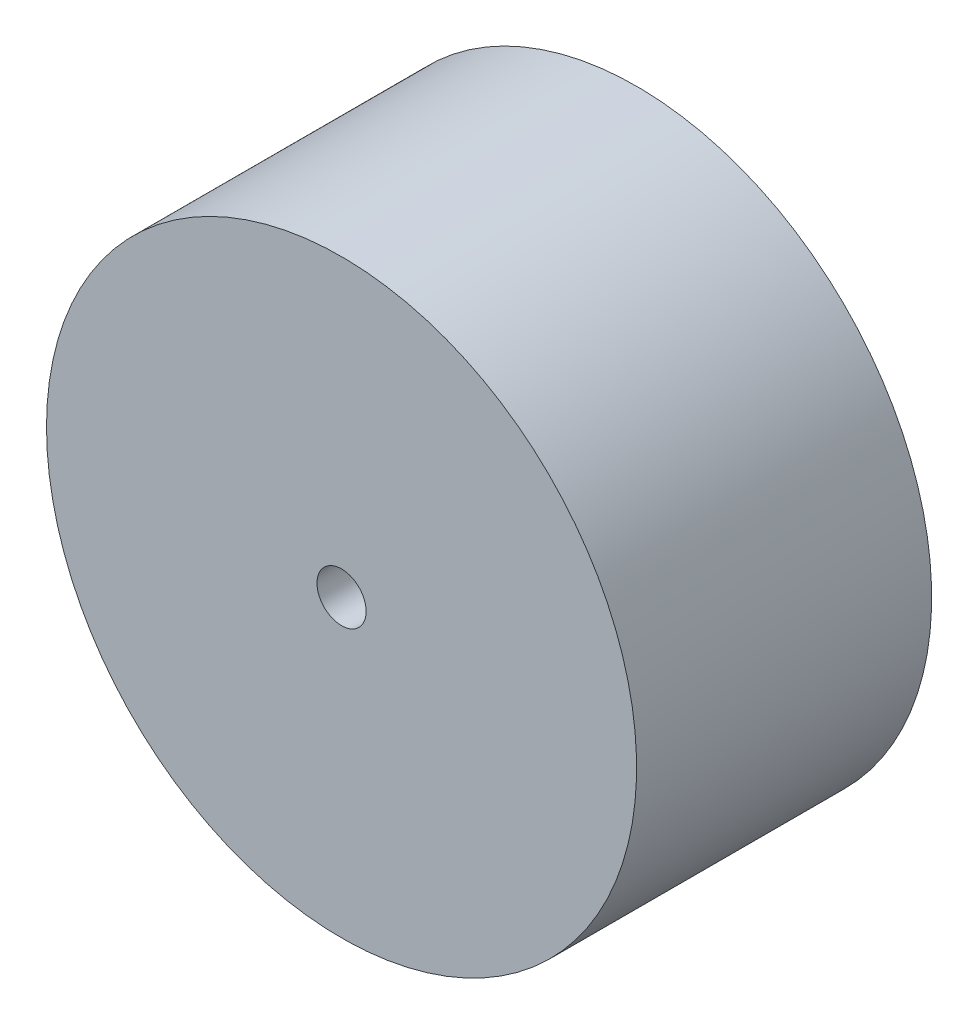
ISO-10303-21;
HEADER;
FILE_DESCRIPTION(('STEP AP214'),'2;1');
FILE_NAME('part.step','',(''),(''),'','','');
FILE_SCHEMA(('AUTOMOTIVE_DESIGN { 1 0 10303 214 1 1 1 1 }'));
ENDSEC;
DATA;
#1=APPLICATION_CONTEXT('core data for automotive mechanical design processes');
#2=APPLICATION_PROTOCOL_DEFINITION('international standard','automotive_design',2000,#1);
#3=PRODUCT_CONTEXT('',#1,'mechanical');
#4=PRODUCT('Part','Part','',(#3));
#5=PRODUCT_RELATED_PRODUCT_CATEGORY('part','',(#4));
#6=PRODUCT_DEFINITION_FORMATION('','',#4);
#7=PRODUCT_DEFINITION_CONTEXT('part definition',#1,'design');
#8=PRODUCT_DEFINITION('design','',#6,#7);
#9=PRODUCT_DEFINITION_SHAPE('','',#8);
#10=(LENGTH_UNIT() NAMED_UNIT(*) SI_UNIT(.MILLI.,.METRE.));
#11=(NAMED_UNIT(*) PLANE_ANGLE_UNIT() SI_UNIT($,.RADIAN.));
#12=(NAMED_UNIT(*) SI_UNIT($,.STERADIAN.) SOLID_ANGLE_UNIT());
#13=UNCERTAINTY_MEASURE_WITH_UNIT(LENGTH_MEASURE(1.E-05),#10,'distance_accuracy_value','');
#14=(GEOMETRIC_REPRESENTATION_CONTEXT(3) GLOBAL_UNCERTAINTY_ASSIGNED_CONTEXT((#13)) GLOBAL_UNIT_ASSIGNED_CONTEXT((#10,
#11,#12)) REPRESENTATION_CONTEXT('',''));
#15=CARTESIAN_POINT('',(0.,0.,0.));
#16=DIRECTION('',(0.,0.,1.));
#17=DIRECTION('',(1.,0.,0.));
#18=AXIS2_PLACEMENT_3D('',#15,#16,#17);
#19=CARTESIAN_POINT('',(0.,0.,38.1));
#20=DIRECTION('',(0.,0.,-1.));
#21=DIRECTION('',(-1.,0.,0.));
#22=AXIS2_PLACEMENT_3D('',#19,#20,#21);
#23=CYLINDRICAL_SURFACE('',#22,38.1);
#24=CARTESIAN_POINT('',(0.,0.,38.1));
#25=DIRECTION('',(0.,0.,1.));
#26=DIRECTION('',(1.,0.,0.));
#27=AXIS2_PLACEMENT_3D('',#24,#25,#26);
#28=CIRCLE('',#27,38.1);
#29=CARTESIAN_POINT('',(-38.1,0.,38.1));
#30=VERTEX_POINT('',#29);
#31=EDGE_CURVE('E10',#30,#30,#28,.T.);
#32=CARTESIAN_POINT('',(0.,0.,0.));
#33=DIRECTION('',(0.,0.,1.));
#34=DIRECTION('',(1.,0.,0.));
#35=AXIS2_PLACEMENT_3D('',#32,#33,#34);
#36=CIRCLE('',#35,38.1);
#37=CARTESIAN_POINT('',(-38.1,0.,0.));
#38=VERTEX_POINT('',#37);
#39=EDGE_CURVE('E44',#38,#38,#36,.T.);
#40=CARTESIAN_POINT('',(-38.1,0.,38.1));
#41=CARTESIAN_POINT('',(-38.1,0.,37.703125));
#42=CARTESIAN_POINT('',(-38.1,0.,37.30625));
#43=CARTESIAN_POINT('',(-38.1,0.,36.5125));
#44=CARTESIAN_POINT('',(-38.1,0.,36.115625));
#45=CARTESIAN_POINT('',(-38.1,0.,35.321875));
#46=CARTESIAN_POINT('',(-38.1,0.,34.925));
#47=CARTESIAN_POINT('',(-38.1,0.,34.13125));
#48=CARTESIAN_POINT('',(-38.1,0.,33.734375));
#49=CARTESIAN_POINT('',(-38.1,0.,32.940625));
#50=CARTESIAN_POINT('',(-38.1,0.,32.54375));
#51=CARTESIAN_POINT('',(-38.1,0.,31.75));
#52=CARTESIAN_POINT('',(-38.1,0.,31.353125));
#53=CARTESIAN_POINT('',(-38.1,0.,30.559375));
#54=CARTESIAN_POINT('',(-38.1,0.,30.1625));
#55=CARTESIAN_POINT('',(-38.1,0.,29.36875));
#56=CARTESIAN_POINT('',(-38.1,0.,28.971875));
#57=CARTESIAN_POINT('',(-38.1,0.,28.178125));
#58=CARTESIAN_POINT('',(-38.1,0.,27.78125));
#59=CARTESIAN_POINT('',(-38.1,0.,26.9875));
#60=CARTESIAN_POINT('',(-38.1,0.,26.590625));
#61=CARTESIAN_POINT('',(-38.1,0.,25.796875));
#62=CARTESIAN_POINT('',(-38.1,0.,25.4));
#63=CARTESIAN_POINT('',(-38.1,0.,24.60625));
#64=CARTESIAN_POINT('',(-38.1,0.,24.209375));
#65=CARTESIAN_POINT('',(-38.1,0.,23.415625));
#66=CARTESIAN_POINT('',(-38.1,0.,23.01875));
#67=CARTESIAN_POINT('',(-38.1,0.,22.225));
#68=CARTESIAN_POINT('',(-38.1,0.,21.828125));
#69=CARTESIAN_POINT('',(-38.1,0.,21.034375));
#70=CARTESIAN_POINT('',(-38.1,0.,20.6375));
#71=CARTESIAN_POINT('',(-38.1,0.,19.84375));
#72=CARTESIAN_POINT('',(-38.1,0.,19.446875));
#73=CARTESIAN_POINT('',(-38.1,0.,18.653125));
#74=CARTESIAN_POINT('',(-38.1,0.,18.25625));
#75=CARTESIAN_POINT('',(-38.1,0.,17.4625));
#76=CARTESIAN_POINT('',(-38.1,0.,17.065625));
#77=CARTESIAN_POINT('',(-38.1,0.,16.271875));
#78=CARTESIAN_POINT('',(-38.1,0.,15.875));
#79=CARTESIAN_POINT('',(-38.1,0.,15.08125));
#80=CARTESIAN_POINT('',(-38.1,0.,14.684375));
#81=CARTESIAN_POINT('',(-38.1,0.,13.890625));
#82=CARTESIAN_POINT('',(-38.1,0.,13.49375));
#83=CARTESIAN_POINT('',(-38.1,0.,12.7));
#84=CARTESIAN_POINT('',(-38.1,0.,12.303125));
#85=CARTESIAN_POINT('',(-38.1,0.,11.509375));
#86=CARTESIAN_POINT('',(-38.1,0.,11.1125));
#87=CARTESIAN_POINT('',(-38.1,0.,10.31875));
#88=CARTESIAN_POINT('',(-38.1,0.,9.92187499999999));
#89=CARTESIAN_POINT('',(-38.1,0.,9.128125));
#90=CARTESIAN_POINT('',(-38.1,0.,8.73124999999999));
#91=CARTESIAN_POINT('',(-38.1,0.,7.93749999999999));
#92=CARTESIAN_POINT('',(-38.1,0.,7.54062499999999));
#93=CARTESIAN_POINT('',(-38.1,0.,6.746875));
#94=CARTESIAN_POINT('',(-38.1,0.,6.35));
#95=CARTESIAN_POINT('',(-38.1,0.,5.55625));
#96=CARTESIAN_POINT('',(-38.1,0.,5.159375));
#97=CARTESIAN_POINT('',(-38.1,0.,4.365625));
#98=CARTESIAN_POINT('',(-38.1,0.,3.96875));
#99=CARTESIAN_POINT('',(-38.1,0.,3.175));
#100=CARTESIAN_POINT('',(-38.1,0.,2.778125));
#101=CARTESIAN_POINT('',(-38.1,0.,1.984375));
#102=CARTESIAN_POINT('',(-38.1,0.,1.5875));
#103=CARTESIAN_POINT('',(-38.1,0.,0.79375));
#104=CARTESIAN_POINT('',(-38.1,0.,0.396875));
#105=CARTESIAN_POINT('',(-38.1,0.,0.));
#106=B_SPLINE_CURVE_WITH_KNOTS('',3,(#40,#41,#42,#43,#44,#45,#46,#47,#48,#49,#50,#51,#52,#53,
#54,#55,#56,#57,#58,#59,#60,#61,#62,#63,#64,#65,#66,#67,#68,#69,#70,#71,#72,#73,#74,#75,#76,#77,
#78,#79,#80,#81,#82,#83,#84,#85,#86,#87,#88,#89,#90,#91,#92,#93,#94,#95,#96,#97,#98,#99,#100,
#101,#102,#103,#104,#105),.UNSPECIFIED.,.F.,.F.,(4,2,2,2,2,2,2,2,2,2,2,2,2,2,2,2,2,2,2,2,2,2,2,
2,2,2,2,2,2,2,2,2,4),(0.,1.190625,2.38125,3.571875,4.7625,5.953125,7.14375,8.334375,
9.52500000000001,10.715625,11.90625,13.096875,14.2875,15.478125,16.66875,17.859375,19.05,
20.240625,21.43125,22.621875,23.8125,25.003125,26.19375,27.384375,28.575,29.765625,30.95625,
32.146875,33.3375,34.528125,35.71875,36.909375,38.1),.UNSPECIFIED.);
#107=EDGE_CURVE('BSEAM41',#30,#38,#106,.T.);
#108=ORIENTED_EDGE('',*,*,#31,.F.);
#109=ORIENTED_EDGE('',*,*,#39,.T.);
#110=ORIENTED_EDGE('',*,*,#107,.T.);
#111=ORIENTED_EDGE('',*,*,#107,.F.);
#112=EDGE_LOOP('',(#108,#110,#109,#111));
#113=FACE_BOUND('',#112,.T.);
#114=ADVANCED_FACE('F41',(#113),#23,.T.);
#115=CARTESIAN_POINT('',(0.,0.,38.1));
#116=DIRECTION('',(0.,0.,1.));
#117=DIRECTION('',(1.,0.,0.));
#118=AXIS2_PLACEMENT_3D('',#115,#116,#117);
#119=PLANE('',#118);
#120=CARTESIAN_POINT('',(0.,0.,38.1));
#121=DIRECTION('',(0.,0.,1.));
#122=DIRECTION('',(1.,0.,0.));
#123=AXIS2_PLACEMENT_3D('',#120,#121,#122);
#124=CIRCLE('',#123,3.175);
#125=CARTESIAN_POINT('',(3.175,0.,38.1));
#126=VERTEX_POINT('',#125);
#127=EDGE_CURVE('E55',#126,#126,#124,.T.);
#128=ORIENTED_EDGE('',*,*,#127,.F.);
#129=EDGE_LOOP('',(#128));
#130=FACE_BOUND('',#129,.T.);
#131=ORIENTED_EDGE('',*,*,#31,.T.);
#132=EDGE_LOOP('',(#131));
#133=FACE_BOUND('',#132,.T.);
#134=ADVANCED_FACE('F72',(#130,#133),#119,.T.);
#135=CARTESIAN_POINT('',(0.,0.,0.));
#136=DIRECTION('',(0.,0.,1.));
#137=DIRECTION('',(1.,0.,0.));
#138=AXIS2_PLACEMENT_3D('',#135,#136,#137);
#139=PLANE('',#138);
#140=CARTESIAN_POINT('',(0.,0.,0.));
#141=DIRECTION('',(0.,0.,1.));
#142=DIRECTION('',(1.,0.,0.));
#143=AXIS2_PLACEMENT_3D('',#140,#141,#142);
#144=CIRCLE('',#143,3.175);
#145=CARTESIAN_POINT('',(3.175,0.,0.));
#146=VERTEX_POINT('',#145);
#147=EDGE_CURVE('E53',#146,#146,#144,.T.);
#148=ORIENTED_EDGE('',*,*,#147,.T.);
#149=EDGE_LOOP('',(#148));
#150=FACE_BOUND('',#149,.T.);
#151=ORIENTED_EDGE('',*,*,#39,.F.);
#152=EDGE_LOOP('',(#151));
#153=FACE_BOUND('',#152,.T.);
#154=ADVANCED_FACE('F63',(#150,#153),#139,.F.);
#155=CARTESIAN_POINT('',(0.,0.,0.));
#156=DIRECTION('',(0.,0.,1.));
#157=DIRECTION('',(1.,0.,0.));
#158=AXIS2_PLACEMENT_3D('',#155,#156,#157);
#159=CYLINDRICAL_SURFACE('',#158,3.175);
#160=CARTESIAN_POINT('',(3.175,0.,0.));
#161=CARTESIAN_POINT('',(3.175,0.,0.396875));
#162=CARTESIAN_POINT('',(3.175,0.,0.79375));
#163=CARTESIAN_POINT('',(3.175,0.,1.5875));
#164=CARTESIAN_POINT('',(3.175,0.,1.984375));
#165=CARTESIAN_POINT('',(3.175,0.,2.778125));
#166=CARTESIAN_POINT('',(3.175,0.,3.175));
#167=CARTESIAN_POINT('',(3.175,0.,3.96875));
#168=CARTESIAN_POINT('',(3.175,0.,4.365625));
#169=CARTESIAN_POINT('',(3.175,0.,5.159375));
#170=CARTESIAN_POINT('',(3.175,0.,5.55625));
#171=CARTESIAN_POINT('',(3.175,0.,6.35));
#172=CARTESIAN_POINT('',(3.175,0.,6.746875));
#173=CARTESIAN_POINT('',(3.175,0.,7.540625));
#174=CARTESIAN_POINT('',(3.175,0.,7.9375));
#175=CARTESIAN_POINT('',(3.175,0.,8.73125));
#176=CARTESIAN_POINT('',(3.175,0.,9.128125));
#177=CARTESIAN_POINT('',(3.175,0.,9.921875));
#178=CARTESIAN_POINT('',(3.175,0.,10.31875));
#179=CARTESIAN_POINT('',(3.175,0.,11.1125));
#180=CARTESIAN_POINT('',(3.175,0.,11.509375));
#181=CARTESIAN_POINT('',(3.175,0.,12.303125));
#182=CARTESIAN_POINT('',(3.175,0.,12.7));
#183=CARTESIAN_POINT('',(3.175,0.,13.49375));
#184=CARTESIAN_POINT('',(3.175,0.,13.890625));
#185=CARTESIAN_POINT('',(3.175,0.,14.684375));
#186=CARTESIAN_POINT('',(3.175,0.,15.08125));
#187=CARTESIAN_POINT('',(3.175,0.,15.875));
#188=CARTESIAN_POINT('',(3.175,0.,16.271875));
#189=CARTESIAN_POINT('',(3.175,0.,17.065625));
#190=CARTESIAN_POINT('',(3.175,0.,17.4625));
#191=CARTESIAN_POINT('',(3.175,0.,18.25625));
#192=CARTESIAN_POINT('',(3.175,0.,18.653125));
#193=CARTESIAN_POINT('',(3.175,0.,19.446875));
#194=CARTESIAN_POINT('',(3.175,0.,19.84375));
#195=CARTESIAN_POINT('',(3.175,0.,20.6375));
#196=CARTESIAN_POINT('',(3.175,0.,21.034375));
#197=CARTESIAN_POINT('',(3.175,0.,21.828125));
#198=CARTESIAN_POINT('',(3.175,0.,22.225));
#199=CARTESIAN_POINT('',(3.175,0.,23.01875));
#200=CARTESIAN_POINT('',(3.175,0.,23.415625));
#201=CARTESIAN_POINT('',(3.175,0.,24.209375));
#202=CARTESIAN_POINT('',(3.175,0.,24.60625));
#203=CARTESIAN_POINT('',(3.175,0.,25.4));
#204=CARTESIAN_POINT('',(3.175,0.,25.796875));
#205=CARTESIAN_POINT('',(3.175,0.,26.590625));
#206=CARTESIAN_POINT('',(3.175,0.,26.9875));
#207=CARTESIAN_POINT('',(3.175,0.,27.78125));
#208=CARTESIAN_POINT('',(3.175,0.,28.178125));
#209=CARTESIAN_POINT('',(3.175,0.,28.971875));
#210=CARTESIAN_POINT('',(3.175,0.,29.36875));
#211=CARTESIAN_POINT('',(3.175,0.,30.1625));
#212=CARTESIAN_POINT('',(3.175,0.,30.559375));
#213=CARTESIAN_POINT('',(3.175,0.,31.353125));
#214=CARTESIAN_POINT('',(3.175,0.,31.75));
#215=CARTESIAN_POINT('',(3.175,0.,32.54375));
#216=CARTESIAN_POINT('',(3.175,0.,32.940625));
#217=CARTESIAN_POINT('',(3.175,0.,33.734375));
#218=CARTESIAN_POINT('',(3.175,0.,34.13125));
#219=CARTESIAN_POINT('',(3.175,0.,34.925));
#220=CARTESIAN_POINT('',(3.175,0.,35.321875));
#221=CARTESIAN_POINT('',(3.175,0.,36.115625));
#222=CARTESIAN_POINT('',(3.175,0.,36.5125));
#223=CARTESIAN_POINT('',(3.175,0.,37.30625));
#224=CARTESIAN_POINT('',(3.175,0.,37.703125));
#225=CARTESIAN_POINT('',(3.175,0.,38.1));
#226=B_SPLINE_CURVE_WITH_KNOTS('',3,(#160,#161,#162,#163,#164,#165,#166,#167,#168,#169,#170,
#171,#172,#173,#174,#175,#176,#177,#178,#179,#180,#181,#182,#183,#184,#185,#186,#187,#188,#189,
#190,#191,#192,#193,#194,#195,#196,#197,#198,#199,#200,#201,#202,#203,#204,#205,#206,#207,#208,
#209,#210,#211,#212,#213,#214,#215,#216,#217,#218,#219,#220,#221,#222,#223,#224,#225),
.UNSPECIFIED.,.F.,.F.,(4,2,2,2,2,2,2,2,2,2,2,2,2,2,2,2,2,2,2,2,2,2,2,2,2,2,2,2,2,2,2,2,4),(0.,
1.190625,2.38125,3.571875,4.7625,5.953125,7.14375,8.334375,9.525,10.715625,11.90625,13.096875,
14.2875,15.478125,16.66875,17.859375,19.05,20.240625,21.43125,22.621875,23.8125,25.003125,
26.19375,27.384375,28.575,29.765625,30.95625,32.146875,33.3375,34.528125,35.71875,36.909375,
38.1),.UNSPECIFIED.);
#227=EDGE_CURVE('BSEAM66',#146,#126,#226,.T.);
#228=ORIENTED_EDGE('',*,*,#147,.F.);
#229=ORIENTED_EDGE('',*,*,#127,.T.);
#230=ORIENTED_EDGE('',*,*,#227,.T.);
#231=ORIENTED_EDGE('',*,*,#227,.F.);
#232=EDGE_LOOP('',(#228,#230,#229,#231));
#233=FACE_BOUND('',#232,.T.);
#234=ADVANCED_FACE('F66',(#233),#159,.F.);
#235=CLOSED_SHELL('',(#114,#134,#154,#234));
#236=MANIFOLD_SOLID_BREP('B2',#235);
#237=ADVANCED_BREP_SHAPE_REPRESENTATION('',(#18,#236),#14);
#238=SHAPE_DEFINITION_REPRESENTATION(#9,#237);
ENDSEC;
END-ISO-10303-21;
